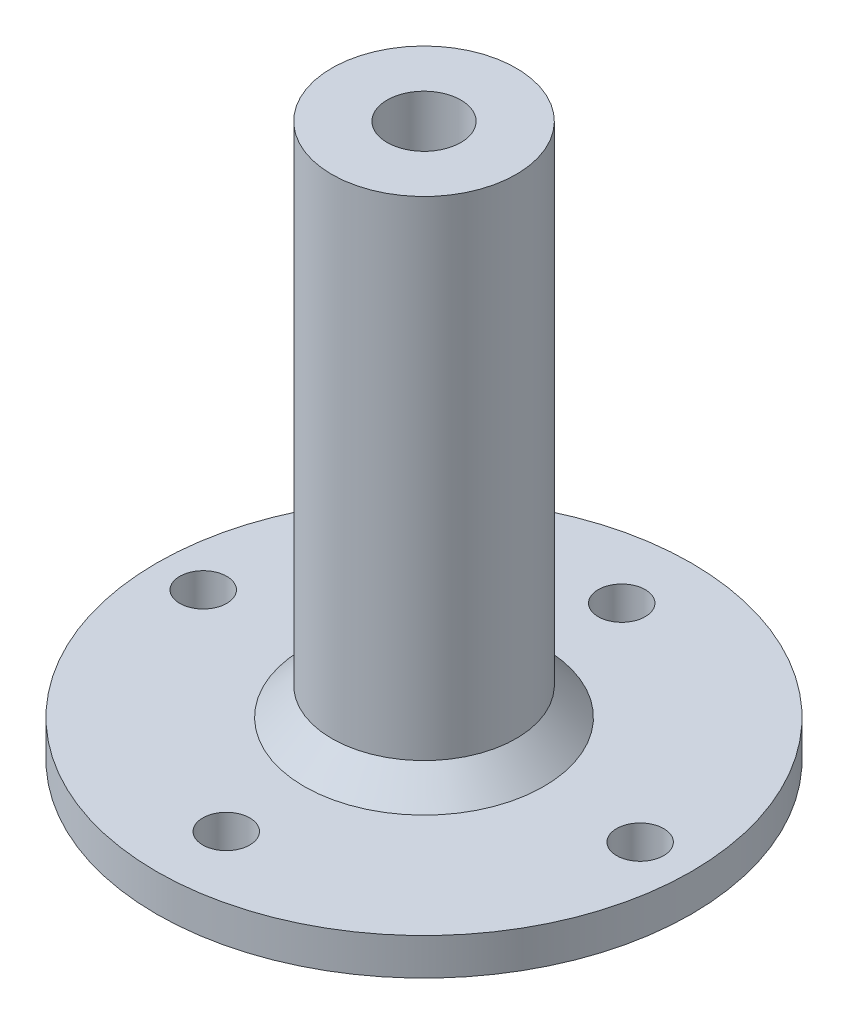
ISO-10303-21;
HEADER;
FILE_DESCRIPTION(('STEP AP214'),'2;1');
FILE_NAME('part.step','',(''),(''),'','','');
FILE_SCHEMA(('AUTOMOTIVE_DESIGN { 1 0 10303 214 1 1 1 1 }'));
ENDSEC;
DATA;
#1=APPLICATION_CONTEXT('core data for automotive mechanical design processes');
#2=APPLICATION_PROTOCOL_DEFINITION('international standard','automotive_design',2000,#1);
#3=PRODUCT_CONTEXT('',#1,'mechanical');
#4=PRODUCT('Part','Part','',(#3));
#5=PRODUCT_RELATED_PRODUCT_CATEGORY('part','',(#4));
#6=PRODUCT_DEFINITION_FORMATION('','',#4);
#7=PRODUCT_DEFINITION_CONTEXT('part definition',#1,'design');
#8=PRODUCT_DEFINITION('design','',#6,#7);
#9=PRODUCT_DEFINITION_SHAPE('','',#8);
#10=(LENGTH_UNIT() NAMED_UNIT(*) SI_UNIT(.MILLI.,.METRE.));
#11=(NAMED_UNIT(*) PLANE_ANGLE_UNIT() SI_UNIT($,.RADIAN.));
#12=(NAMED_UNIT(*) SI_UNIT($,.STERADIAN.) SOLID_ANGLE_UNIT());
#13=UNCERTAINTY_MEASURE_WITH_UNIT(LENGTH_MEASURE(1.E-05),#10,'distance_accuracy_value','');
#14=(GEOMETRIC_REPRESENTATION_CONTEXT(3) GLOBAL_UNCERTAINTY_ASSIGNED_CONTEXT((#13)) GLOBAL_UNIT_ASSIGNED_CONTEXT((#10,
#11,#12)) REPRESENTATION_CONTEXT('',''));
#15=CARTESIAN_POINT('',(0.,0.,0.));
#16=DIRECTION('',(0.,0.,1.));
#17=DIRECTION('',(1.,0.,0.));
#18=AXIS2_PLACEMENT_3D('',#15,#16,#17);
#19=CARTESIAN_POINT('',(0.,4.,0.));
#20=DIRECTION('',(0.,1.,0.));
#21=DIRECTION('',(0.,0.,1.));
#22=AXIS2_PLACEMENT_3D('',#19,#20,#21);
#23=PLANE('',#22);
#24=CARTESIAN_POINT('',(0.,4.,0.));
#25=DIRECTION('',(0.,1.,0.));
#26=DIRECTION('',(0.,0.,1.));
#27=AXIS2_PLACEMENT_3D('',#24,#25,#26);
#28=CIRCLE('',#27,13.);
#29=CARTESIAN_POINT('',(0.,4.,13.));
#30=VERTEX_POINT('',#29);
#31=EDGE_CURVE('E10',#30,#30,#28,.F.);
#32=ORIENTED_EDGE('',*,*,#31,.T.);
#33=EDGE_LOOP('',(#32));
#34=FACE_BOUND('',#33,.T.);
#35=CARTESIAN_POINT('',(0.,4.,-21.45));
#36=DIRECTION('',(0.,1.,0.));
#37=DIRECTION('',(0.,0.,1.));
#38=AXIS2_PLACEMENT_3D('',#35,#36,#37);
#39=CIRCLE('',#38,2.55);
#40=CARTESIAN_POINT('',(0.,4.,-18.9));
#41=VERTEX_POINT('',#40);
#42=EDGE_CURVE('E83',#41,#41,#39,.T.);
#43=ORIENTED_EDGE('',*,*,#42,.F.);
#44=EDGE_LOOP('',(#43));
#45=FACE_BOUND('',#44,.T.);
#46=CARTESIAN_POINT('',(-23.95,4.,0.));
#47=DIRECTION('',(0.,1.,0.));
#48=DIRECTION('',(0.,0.,1.));
#49=AXIS2_PLACEMENT_3D('',#46,#47,#48);
#50=CIRCLE('',#49,2.55);
#51=CARTESIAN_POINT('',(-23.95,4.,2.55));
#52=VERTEX_POINT('',#51);
#53=EDGE_CURVE('E69',#52,#52,#50,.T.);
#54=ORIENTED_EDGE('',*,*,#53,.F.);
#55=EDGE_LOOP('',(#54));
#56=FACE_BOUND('',#55,.T.);
#57=CARTESIAN_POINT('',(0.,4.,0.));
#58=DIRECTION('',(0.,1.,0.));
#59=DIRECTION('',(0.,0.,1.));
#60=AXIS2_PLACEMENT_3D('',#57,#58,#59);
#61=CIRCLE('',#60,29.);
#62=CARTESIAN_POINT('',(0.,4.,29.));
#63=VERTEX_POINT('',#62);
#64=EDGE_CURVE('E59',#63,#63,#61,.T.);
#65=ORIENTED_EDGE('',*,*,#64,.T.);
#66=EDGE_LOOP('',(#65));
#67=FACE_BOUND('',#66,.T.);
#68=CARTESIAN_POINT('',(23.45,4.,0.));
#69=DIRECTION('',(0.,1.,0.));
#70=DIRECTION('',(0.,0.,1.));
#71=AXIS2_PLACEMENT_3D('',#68,#69,#70);
#72=CIRCLE('',#71,2.55);
#73=CARTESIAN_POINT('',(23.45,4.,2.55));
#74=VERTEX_POINT('',#73);
#75=EDGE_CURVE('E75',#74,#74,#72,.T.);
#76=ORIENTED_EDGE('',*,*,#75,.F.);
#77=EDGE_LOOP('',(#76));
#78=FACE_BOUND('',#77,.T.);
#79=CARTESIAN_POINT('',(0.,4.,21.45));
#80=DIRECTION('',(0.,1.,0.));
#81=DIRECTION('',(0.,0.,1.));
#82=AXIS2_PLACEMENT_3D('',#79,#80,#81);
#83=CIRCLE('',#82,2.55);
#84=CARTESIAN_POINT('',(0.,4.,24.));
#85=VERTEX_POINT('',#84);
#86=EDGE_CURVE('E91',#85,#85,#83,.T.);
#87=ORIENTED_EDGE('',*,*,#86,.F.);
#88=EDGE_LOOP('',(#87));
#89=FACE_BOUND('',#88,.T.);
#90=ADVANCED_FACE('F45',(#34,#45,#56,#67,#78,#89),#23,.T.);
#91=CARTESIAN_POINT('',(0.,0.,0.));
#92=DIRECTION('',(0.,1.,0.));
#93=DIRECTION('',(0.,0.,1.));
#94=AXIS2_PLACEMENT_3D('',#91,#92,#93);
#95=PLANE('',#94);
#96=CARTESIAN_POINT('',(0.,0.,0.));
#97=DIRECTION('',(0.,1.,0.));
#98=DIRECTION('',(0.,0.,1.));
#99=AXIS2_PLACEMENT_3D('',#96,#97,#98);
#100=CIRCLE('',#99,4.);
#101=CARTESIAN_POINT('',(0.,0.,4.));
#102=VERTEX_POINT('',#101);
#103=EDGE_CURVE('E106',#102,#102,#100,.T.);
#104=ORIENTED_EDGE('',*,*,#103,.T.);
#105=EDGE_LOOP('',(#104));
#106=FACE_BOUND('',#105,.T.);
#107=CARTESIAN_POINT('',(0.,0.,0.));
#108=DIRECTION('',(0.,1.,0.));
#109=DIRECTION('',(0.,0.,1.));
#110=AXIS2_PLACEMENT_3D('',#107,#108,#109);
#111=CIRCLE('',#110,29.);
#112=CARTESIAN_POINT('',(0.,0.,29.));
#113=VERTEX_POINT('',#112);
#114=EDGE_CURVE('E64',#113,#113,#111,.T.);
#115=ORIENTED_EDGE('',*,*,#114,.F.);
#116=EDGE_LOOP('',(#115));
#117=FACE_BOUND('',#116,.T.);
#118=CARTESIAN_POINT('',(-23.95,0.,0.));
#119=DIRECTION('',(0.,1.,0.));
#120=DIRECTION('',(0.,0.,1.));
#121=AXIS2_PLACEMENT_3D('',#118,#119,#120);
#122=CIRCLE('',#121,2.55);
#123=CARTESIAN_POINT('',(-23.95,0.,2.55));
#124=VERTEX_POINT('',#123);
#125=EDGE_CURVE('E71',#124,#124,#122,.T.);
#126=ORIENTED_EDGE('',*,*,#125,.T.);
#127=EDGE_LOOP('',(#126));
#128=FACE_BOUND('',#127,.T.);
#129=CARTESIAN_POINT('',(23.45,0.,0.));
#130=DIRECTION('',(0.,1.,0.));
#131=DIRECTION('',(0.,0.,1.));
#132=AXIS2_PLACEMENT_3D('',#129,#130,#131);
#133=CIRCLE('',#132,2.55);
#134=CARTESIAN_POINT('',(23.45,0.,2.55));
#135=VERTEX_POINT('',#134);
#136=EDGE_CURVE('E79',#135,#135,#133,.T.);
#137=ORIENTED_EDGE('',*,*,#136,.T.);
#138=EDGE_LOOP('',(#137));
#139=FACE_BOUND('',#138,.T.);
#140=CARTESIAN_POINT('',(0.,0.,-21.45));
#141=DIRECTION('',(0.,1.,0.));
#142=DIRECTION('',(0.,0.,1.));
#143=AXIS2_PLACEMENT_3D('',#140,#141,#142);
#144=CIRCLE('',#143,2.55);
#145=CARTESIAN_POINT('',(0.,0.,-18.9));
#146=VERTEX_POINT('',#145);
#147=EDGE_CURVE('E87',#146,#146,#144,.T.);
#148=ORIENTED_EDGE('',*,*,#147,.T.);
#149=EDGE_LOOP('',(#148));
#150=FACE_BOUND('',#149,.T.);
#151=CARTESIAN_POINT('',(0.,0.,21.45));
#152=DIRECTION('',(0.,1.,0.));
#153=DIRECTION('',(0.,0.,1.));
#154=AXIS2_PLACEMENT_3D('',#151,#152,#153);
#155=CIRCLE('',#154,2.55);
#156=CARTESIAN_POINT('',(0.,0.,24.));
#157=VERTEX_POINT('',#156);
#158=EDGE_CURVE('E95',#157,#157,#155,.T.);
#159=ORIENTED_EDGE('',*,*,#158,.T.);
#160=EDGE_LOOP('',(#159));
#161=FACE_BOUND('',#160,.T.);
#162=ADVANCED_FACE('F115',(#106,#117,#128,#139,#150,#161),#95,.F.);
#163=CARTESIAN_POINT('',(0.,4.,0.));
#164=DIRECTION('',(0.,-1.,0.));
#165=DIRECTION('',(0.,0.,-1.));
#166=AXIS2_PLACEMENT_3D('',#163,#164,#165);
#167=CYLINDRICAL_SURFACE('',#166,29.);
#168=ORIENTED_EDGE('',*,*,#64,.F.);
#169=EDGE_LOOP('',(#168));
#170=FACE_BOUND('',#169,.T.);
#171=ORIENTED_EDGE('',*,*,#114,.T.);
#172=EDGE_LOOP('',(#171));
#173=FACE_BOUND('',#172,.T.);
#174=ADVANCED_FACE('F146',(#170,#173),#167,.T.);
#175=CARTESIAN_POINT('',(-23.95,4.,0.));
#176=DIRECTION('',(0.,-1.,0.));
#177=DIRECTION('',(0.,0.,-1.));
#178=AXIS2_PLACEMENT_3D('',#175,#176,#177);
#179=CYLINDRICAL_SURFACE('',#178,2.55);
#180=ORIENTED_EDGE('',*,*,#53,.T.);
#181=EDGE_LOOP('',(#180));
#182=FACE_BOUND('',#181,.T.);
#183=ORIENTED_EDGE('',*,*,#125,.F.);
#184=EDGE_LOOP('',(#183));
#185=FACE_BOUND('',#184,.T.);
#186=ADVANCED_FACE('F150',(#182,#185),#179,.F.);
#187=CARTESIAN_POINT('',(23.45,4.,0.));
#188=DIRECTION('',(0.,-1.,0.));
#189=DIRECTION('',(0.,0.,-1.));
#190=AXIS2_PLACEMENT_3D('',#187,#188,#189);
#191=CYLINDRICAL_SURFACE('',#190,2.55);
#192=ORIENTED_EDGE('',*,*,#75,.T.);
#193=EDGE_LOOP('',(#192));
#194=FACE_BOUND('',#193,.T.);
#195=ORIENTED_EDGE('',*,*,#136,.F.);
#196=EDGE_LOOP('',(#195));
#197=FACE_BOUND('',#196,.T.);
#198=ADVANCED_FACE('F157',(#194,#197),#191,.F.);
#199=CARTESIAN_POINT('',(0.,4.,-21.45));
#200=DIRECTION('',(0.,-1.,0.));
#201=DIRECTION('',(0.,0.,-1.));
#202=AXIS2_PLACEMENT_3D('',#199,#200,#201);
#203=CYLINDRICAL_SURFACE('',#202,2.55);
#204=ORIENTED_EDGE('',*,*,#42,.T.);
#205=EDGE_LOOP('',(#204));
#206=FACE_BOUND('',#205,.T.);
#207=ORIENTED_EDGE('',*,*,#147,.F.);
#208=EDGE_LOOP('',(#207));
#209=FACE_BOUND('',#208,.T.);
#210=ADVANCED_FACE('F139',(#206,#209),#203,.F.);
#211=CARTESIAN_POINT('',(0.,4.,21.45));
#212=DIRECTION('',(0.,-1.,0.));
#213=DIRECTION('',(0.,0.,-1.));
#214=AXIS2_PLACEMENT_3D('',#211,#212,#213);
#215=CYLINDRICAL_SURFACE('',#214,2.55);
#216=ORIENTED_EDGE('',*,*,#86,.T.);
#217=EDGE_LOOP('',(#216));
#218=FACE_BOUND('',#217,.T.);
#219=ORIENTED_EDGE('',*,*,#158,.F.);
#220=EDGE_LOOP('',(#219));
#221=FACE_BOUND('',#220,.T.);
#222=ADVANCED_FACE('F132',(#218,#221),#215,.F.);
#223=CARTESIAN_POINT('',(0.,60.,0.));
#224=DIRECTION('',(0.,-1.,0.));
#225=DIRECTION('',(0.,0.,-1.));
#226=AXIS2_PLACEMENT_3D('',#223,#224,#225);
#227=CYLINDRICAL_SURFACE('',#226,10.);
#228=CARTESIAN_POINT('',(0.,6.99999999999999,0.));
#229=DIRECTION('',(0.,1.,0.));
#230=DIRECTION('',(0.,0.,1.));
#231=AXIS2_PLACEMENT_3D('',#228,#229,#230);
#232=CIRCLE('',#231,10.);
#233=CARTESIAN_POINT('',(0.,6.99999999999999,10.));
#234=VERTEX_POINT('',#233);
#235=EDGE_CURVE('E54',#234,#234,#232,.T.);
#236=ORIENTED_EDGE('',*,*,#235,.T.);
#237=EDGE_LOOP('',(#236));
#238=FACE_BOUND('',#237,.T.);
#239=CARTESIAN_POINT('',(0.,60.,0.));
#240=DIRECTION('',(0.,1.,0.));
#241=DIRECTION('',(0.,0.,1.));
#242=AXIS2_PLACEMENT_3D('',#239,#240,#241);
#243=CIRCLE('',#242,10.);
#244=CARTESIAN_POINT('',(0.,60.,10.));
#245=VERTEX_POINT('',#244);
#246=EDGE_CURVE('E99',#245,#245,#243,.T.);
#247=ORIENTED_EDGE('',*,*,#246,.F.);
#248=EDGE_LOOP('',(#247));
#249=FACE_BOUND('',#248,.T.);
#250=ADVANCED_FACE('F127',(#238,#249),#227,.T.);
#251=CARTESIAN_POINT('',(0.,60.,0.));
#252=DIRECTION('',(0.,1.,0.));
#253=DIRECTION('',(0.,0.,1.));
#254=AXIS2_PLACEMENT_3D('',#251,#252,#253);
#255=PLANE('',#254);
#256=CARTESIAN_POINT('',(0.,60.,0.));
#257=DIRECTION('',(0.,1.,0.));
#258=DIRECTION('',(0.,0.,1.));
#259=AXIS2_PLACEMENT_3D('',#256,#257,#258);
#260=CIRCLE('',#259,4.);
#261=CARTESIAN_POINT('',(0.,60.,4.));
#262=VERTEX_POINT('',#261);
#263=EDGE_CURVE('E107',#262,#262,#260,.T.);
#264=ORIENTED_EDGE('',*,*,#263,.F.);
#265=EDGE_LOOP('',(#264));
#266=FACE_BOUND('',#265,.T.);
#267=ORIENTED_EDGE('',*,*,#246,.T.);
#268=EDGE_LOOP('',(#267));
#269=FACE_BOUND('',#268,.T.);
#270=ADVANCED_FACE('F124',(#266,#269),#255,.T.);
#271=CARTESIAN_POINT('',(0.,6.99999999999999,0.));
#272=DIRECTION('',(0.,-1.,0.));
#273=DIRECTION('',(0.,0.,-1.));
#274=AXIS2_PLACEMENT_3D('',#271,#272,#273);
#275=CONICAL_SURFACE('',#274,10.,0.785398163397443);
#276=ORIENTED_EDGE('',*,*,#31,.F.);
#277=EDGE_LOOP('',(#276));
#278=FACE_BOUND('',#277,.T.);
#279=ORIENTED_EDGE('',*,*,#235,.F.);
#280=EDGE_LOOP('',(#279));
#281=FACE_BOUND('',#280,.T.);
#282=ADVANCED_FACE('F48',(#278,#281),#275,.T.);
#283=CARTESIAN_POINT('',(0.,0.,0.));
#284=DIRECTION('',(0.,1.,0.));
#285=DIRECTION('',(0.,0.,1.));
#286=AXIS2_PLACEMENT_3D('',#283,#284,#285);
#287=CYLINDRICAL_SURFACE('',#286,4.);
#288=ORIENTED_EDGE('',*,*,#103,.F.);
#289=EDGE_LOOP('',(#288));
#290=FACE_BOUND('',#289,.T.);
#291=ORIENTED_EDGE('',*,*,#263,.T.);
#292=EDGE_LOOP('',(#291));
#293=FACE_BOUND('',#292,.T.);
#294=ADVANCED_FACE('F118',(#290,#293),#287,.F.);
#295=CLOSED_SHELL('',(#90,#162,#174,#186,#198,#210,#222,#250,#270,#282,#294));
#296=MANIFOLD_SOLID_BREP('B2',#295);
#297=ADVANCED_BREP_SHAPE_REPRESENTATION('',(#18,#296),#14);
#298=SHAPE_DEFINITION_REPRESENTATION(#9,#297);
ENDSEC;
END-ISO-10303-21;
